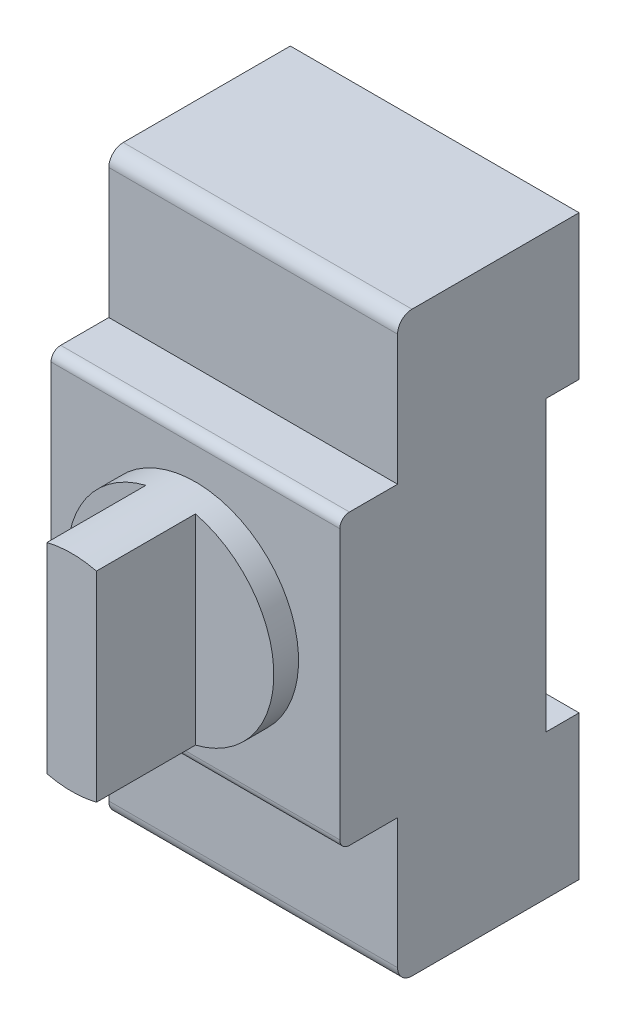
ISO-10303-21;
HEADER;
FILE_DESCRIPTION(('STEP AP214'),'2;1');
FILE_NAME('part.step','',(''),(''),'','','');
FILE_SCHEMA(('AUTOMOTIVE_DESIGN { 1 0 10303 214 1 1 1 1 }'));
ENDSEC;
DATA;
#1=APPLICATION_CONTEXT('core data for automotive mechanical design processes');
#2=APPLICATION_PROTOCOL_DEFINITION('international standard','automotive_design',2000,#1);
#3=PRODUCT_CONTEXT('',#1,'mechanical');
#4=PRODUCT('Part','Part','',(#3));
#5=PRODUCT_RELATED_PRODUCT_CATEGORY('part','',(#4));
#6=PRODUCT_DEFINITION_FORMATION('','',#4);
#7=PRODUCT_DEFINITION_CONTEXT('part definition',#1,'design');
#8=PRODUCT_DEFINITION('design','',#6,#7);
#9=PRODUCT_DEFINITION_SHAPE('','',#8);
#10=(LENGTH_UNIT() NAMED_UNIT(*) SI_UNIT(.MILLI.,.METRE.));
#11=(NAMED_UNIT(*) PLANE_ANGLE_UNIT() SI_UNIT($,.RADIAN.));
#12=(NAMED_UNIT(*) SI_UNIT($,.STERADIAN.) SOLID_ANGLE_UNIT());
#13=UNCERTAINTY_MEASURE_WITH_UNIT(LENGTH_MEASURE(1.E-05),#10,'distance_accuracy_value','');
#14=(GEOMETRIC_REPRESENTATION_CONTEXT(3) GLOBAL_UNCERTAINTY_ASSIGNED_CONTEXT((#13)) GLOBAL_UNIT_ASSIGNED_CONTEXT((#10,
#11,#12)) REPRESENTATION_CONTEXT('',''));
#15=CARTESIAN_POINT('',(0.,0.,0.));
#16=DIRECTION('',(0.,0.,1.));
#17=DIRECTION('',(1.,0.,0.));
#18=AXIS2_PLACEMENT_3D('',#15,#16,#17);
#19=CARTESIAN_POINT('',(35.,0.,25.));
#20=DIRECTION('',(0.,0.,-1.));
#21=DIRECTION('',(-1.,0.,0.));
#22=AXIS2_PLACEMENT_3D('',#19,#20,#21);
#23=PLANE('',#22);
#24=DIRECTION('',(0.,-1.,0.));
#25=VECTOR('',#24,1.);
#26=CARTESIAN_POINT('',(0.,0.,25.));
#27=LINE('',#26,#25);
#28=CARTESIAN_POINT('',(0.,-1.16666666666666,25.));
#29=VERTEX_POINT('',#28);
#30=CARTESIAN_POINT('',(0.,-33.8333333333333,25.));
#31=VERTEX_POINT('',#30);
#32=EDGE_CURVE('E241',#29,#31,#27,.T.);
#33=ORIENTED_EDGE('',*,*,#32,.T.);
#34=DIRECTION('',(-1.,0.,0.));
#35=VECTOR('',#34,1.);
#36=CARTESIAN_POINT('',(35.,-33.8333333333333,25.));
#37=LINE('',#36,#35);
#38=CARTESIAN_POINT('',(35.,-33.8333333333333,25.));
#39=VERTEX_POINT('',#38);
#40=EDGE_CURVE('E305',#31,#39,#37,.F.);
#41=ORIENTED_EDGE('',*,*,#40,.T.);
#42=DIRECTION('',(0.,-1.,0.));
#43=VECTOR('',#42,1.);
#44=CARTESIAN_POINT('',(35.,0.,25.));
#45=LINE('',#44,#43);
#46=CARTESIAN_POINT('',(35.,-1.16666666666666,25.));
#47=VERTEX_POINT('',#46);
#48=EDGE_CURVE('E215',#47,#39,#45,.T.);
#49=ORIENTED_EDGE('',*,*,#48,.F.);
#50=DIRECTION('',(-1.,0.,0.));
#51=VECTOR('',#50,1.);
#52=CARTESIAN_POINT('',(35.,-1.16666666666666,25.));
#53=LINE('',#52,#51);
#54=EDGE_CURVE('E302',#47,#29,#53,.T.);
#55=ORIENTED_EDGE('',*,*,#54,.T.);
#56=EDGE_LOOP('',(#33,#41,#49,#55));
#57=FACE_BOUND('',#56,.T.);
#58=CARTESIAN_POINT('',(17.5,-17.5,25.));
#59=DIRECTION('',(0.,0.,-1.));
#60=DIRECTION('',(-1.,0.,0.));
#61=AXIS2_PLACEMENT_3D('',#58,#59,#60);
#62=CIRCLE('',#61,12.5);
#63=CARTESIAN_POINT('',(5.00000000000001,-17.5,25.));
#64=VERTEX_POINT('',#63);
#65=EDGE_CURVE('E313',#64,#64,#62,.F.);
#66=ORIENTED_EDGE('',*,*,#65,.F.);
#67=EDGE_LOOP('',(#66));
#68=FACE_BOUND('',#67,.T.);
#69=ADVANCED_FACE('F36',(#57,#68),#23,.F.);
#70=CARTESIAN_POINT('',(35.,-35.,0.));
#71=DIRECTION('',(0.,0.,1.));
#72=DIRECTION('',(1.,0.,0.));
#73=AXIS2_PLACEMENT_3D('',#70,#71,#72);
#74=PLANE('',#73);
#75=DIRECTION('',(0.,1.,0.));
#76=VECTOR('',#75,1.);
#77=CARTESIAN_POINT('',(0.,-35.,0.));
#78=LINE('',#77,#76);
#79=CARTESIAN_POINT('',(0.,-35.,0.));
#80=VERTEX_POINT('',#79);
#81=CARTESIAN_POINT('',(0.,0.,0.));
#82=VERTEX_POINT('',#81);
#83=EDGE_CURVE('E190',#80,#82,#78,.T.);
#84=ORIENTED_EDGE('',*,*,#83,.T.);
#85=DIRECTION('',(-1.,0.,0.));
#86=VECTOR('',#85,1.);
#87=CARTESIAN_POINT('',(35.,0.,0.));
#88=LINE('',#87,#86);
#89=CARTESIAN_POINT('',(35.,0.,0.));
#90=VERTEX_POINT('',#89);
#91=EDGE_CURVE('E274',#90,#82,#88,.T.);
#92=ORIENTED_EDGE('',*,*,#91,.F.);
#93=DIRECTION('',(0.,1.,0.));
#94=VECTOR('',#93,1.);
#95=CARTESIAN_POINT('',(35.,-35.,0.));
#96=LINE('',#95,#94);
#97=CARTESIAN_POINT('',(35.,-35.,0.));
#98=VERTEX_POINT('',#97);
#99=EDGE_CURVE('E199',#98,#90,#96,.T.);
#100=ORIENTED_EDGE('',*,*,#99,.F.);
#101=DIRECTION('',(-1.,0.,0.));
#102=VECTOR('',#101,1.);
#103=CARTESIAN_POINT('',(35.,-35.,0.));
#104=LINE('',#103,#102);
#105=EDGE_CURVE('E228',#98,#80,#104,.T.);
#106=ORIENTED_EDGE('',*,*,#105,.T.);
#107=EDGE_LOOP('',(#84,#92,#100,#106));
#108=FACE_BOUND('',#107,.T.);
#109=ADVANCED_FACE('F339',(#108),#74,.F.);
#110=CARTESIAN_POINT('',(35.,0.,0.));
#111=DIRECTION('',(0.,1.,0.));
#112=DIRECTION('',(0.,0.,1.));
#113=AXIS2_PLACEMENT_3D('',#110,#111,#112);
#114=PLANE('',#113);
#115=DIRECTION('',(0.,0.,-1.));
#116=VECTOR('',#115,1.);
#117=CARTESIAN_POINT('',(0.,0.,0.));
#118=LINE('',#117,#116);
#119=CARTESIAN_POINT('',(0.,0.,-4.));
#120=VERTEX_POINT('',#119);
#121=EDGE_CURVE('E194',#82,#120,#118,.T.);
#122=ORIENTED_EDGE('',*,*,#121,.T.);
#123=DIRECTION('',(-1.,0.,0.));
#124=VECTOR('',#123,1.);
#125=CARTESIAN_POINT('',(35.,0.,-4.));
#126=LINE('',#125,#124);
#127=CARTESIAN_POINT('',(35.,0.,-4.));
#128=VERTEX_POINT('',#127);
#129=EDGE_CURVE('E271',#128,#120,#126,.T.);
#130=ORIENTED_EDGE('',*,*,#129,.F.);
#131=DIRECTION('',(0.,0.,-1.));
#132=VECTOR('',#131,1.);
#133=CARTESIAN_POINT('',(35.,0.,0.));
#134=LINE('',#133,#132);
#135=EDGE_CURVE('E202',#90,#128,#134,.T.);
#136=ORIENTED_EDGE('',*,*,#135,.F.);
#137=ORIENTED_EDGE('',*,*,#91,.T.);
#138=EDGE_LOOP('',(#122,#130,#136,#137));
#139=FACE_BOUND('',#138,.T.);
#140=ADVANCED_FACE('F345',(#139),#114,.F.);
#141=CARTESIAN_POINT('',(35.,0.,-4.));
#142=DIRECTION('',(0.,0.,1.));
#143=DIRECTION('',(0.,-1.,0.));
#144=AXIS2_PLACEMENT_3D('',#141,#142,#143);
#145=PLANE('',#144);
#146=DIRECTION('',(0.,1.,0.));
#147=VECTOR('',#146,1.);
#148=CARTESIAN_POINT('',(0.,0.,-4.));
#149=LINE('',#148,#147);
#150=CARTESIAN_POINT('',(0.,17.5,-4.));
#151=VERTEX_POINT('',#150);
#152=EDGE_CURVE('E231',#120,#151,#149,.T.);
#153=ORIENTED_EDGE('',*,*,#152,.T.);
#154=DIRECTION('',(-1.,0.,0.));
#155=VECTOR('',#154,1.);
#156=CARTESIAN_POINT('',(35.,17.5,-4.));
#157=LINE('',#156,#155);
#158=CARTESIAN_POINT('',(35.,17.5,-4.));
#159=VERTEX_POINT('',#158);
#160=EDGE_CURVE('E268',#159,#151,#157,.T.);
#161=ORIENTED_EDGE('',*,*,#160,.F.);
#162=DIRECTION('',(0.,1.,0.));
#163=VECTOR('',#162,1.);
#164=CARTESIAN_POINT('',(35.,0.,-4.));
#165=LINE('',#164,#163);
#166=EDGE_CURVE('E205',#128,#159,#165,.T.);
#167=ORIENTED_EDGE('',*,*,#166,.F.);
#168=ORIENTED_EDGE('',*,*,#129,.T.);
#169=EDGE_LOOP('',(#153,#161,#167,#168));
#170=FACE_BOUND('',#169,.T.);
#171=ADVANCED_FACE('F364',(#170),#145,.F.);
#172=CARTESIAN_POINT('',(35.,17.5,-4.));
#173=DIRECTION('',(0.,-1.,0.));
#174=DIRECTION('',(0.,0.,-1.));
#175=AXIS2_PLACEMENT_3D('',#172,#173,#174);
#176=PLANE('',#175);
#177=DIRECTION('',(0.,0.,1.));
#178=VECTOR('',#177,1.);
#179=CARTESIAN_POINT('',(0.,17.5,-4.));
#180=LINE('',#179,#178);
#181=CARTESIAN_POINT('',(0.,17.5,16.25));
#182=VERTEX_POINT('',#181);
#183=EDGE_CURVE('E233',#151,#182,#180,.T.);
#184=ORIENTED_EDGE('',*,*,#183,.T.);
#185=DIRECTION('',(-1.,0.,0.));
#186=VECTOR('',#185,1.);
#187=CARTESIAN_POINT('',(35.,17.5,16.25));
#188=LINE('',#187,#186);
#189=CARTESIAN_POINT('',(35.,17.5,16.25));
#190=VERTEX_POINT('',#189);
#191=EDGE_CURVE('E293',#182,#190,#188,.F.);
#192=ORIENTED_EDGE('',*,*,#191,.T.);
#193=DIRECTION('',(0.,0.,1.));
#194=VECTOR('',#193,1.);
#195=CARTESIAN_POINT('',(35.,17.5,-4.));
#196=LINE('',#195,#194);
#197=EDGE_CURVE('E207',#159,#190,#196,.T.);
#198=ORIENTED_EDGE('',*,*,#197,.F.);
#199=ORIENTED_EDGE('',*,*,#160,.T.);
#200=EDGE_LOOP('',(#184,#192,#198,#199));
#201=FACE_BOUND('',#200,.T.);
#202=ADVANCED_FACE('F360',(#201),#176,.F.);
#203=CARTESIAN_POINT('',(35.,17.5,18.));
#204=DIRECTION('',(0.,0.,-1.));
#205=DIRECTION('',(-1.,0.,0.));
#206=AXIS2_PLACEMENT_3D('',#203,#204,#205);
#207=PLANE('',#206);
#208=DIRECTION('',(0.,-1.,0.));
#209=VECTOR('',#208,1.);
#210=CARTESIAN_POINT('',(35.,17.5,18.));
#211=LINE('',#210,#209);
#212=CARTESIAN_POINT('',(35.,15.75,18.));
#213=VERTEX_POINT('',#212);
#214=CARTESIAN_POINT('',(35.,0.,18.));
#215=VERTEX_POINT('',#214);
#216=EDGE_CURVE('E210',#213,#215,#211,.T.);
#217=ORIENTED_EDGE('',*,*,#216,.F.);
#218=DIRECTION('',(-1.,0.,0.));
#219=VECTOR('',#218,1.);
#220=CARTESIAN_POINT('',(35.,15.75,18.));
#221=LINE('',#220,#219);
#222=CARTESIAN_POINT('',(0.,15.75,18.));
#223=VERTEX_POINT('',#222);
#224=EDGE_CURVE('E290',#213,#223,#221,.T.);
#225=ORIENTED_EDGE('',*,*,#224,.T.);
#226=DIRECTION('',(0.,-1.,0.));
#227=VECTOR('',#226,1.);
#228=CARTESIAN_POINT('',(0.,17.5,18.));
#229=LINE('',#228,#227);
#230=CARTESIAN_POINT('',(0.,0.,18.));
#231=VERTEX_POINT('',#230);
#232=EDGE_CURVE('E236',#223,#231,#229,.T.);
#233=ORIENTED_EDGE('',*,*,#232,.T.);
#234=DIRECTION('',(-1.,0.,0.));
#235=VECTOR('',#234,1.);
#236=CARTESIAN_POINT('',(35.,0.,18.));
#237=LINE('',#236,#235);
#238=EDGE_CURVE('E265',#215,#231,#237,.T.);
#239=ORIENTED_EDGE('',*,*,#238,.F.);
#240=EDGE_LOOP('',(#217,#225,#233,#239));
#241=FACE_BOUND('',#240,.T.);
#242=ADVANCED_FACE('F356',(#241),#207,.F.);
#243=CARTESIAN_POINT('',(35.,0.,18.));
#244=DIRECTION('',(0.,-1.,0.));
#245=DIRECTION('',(0.,0.,-1.));
#246=AXIS2_PLACEMENT_3D('',#243,#244,#245);
#247=PLANE('',#246);
#248=DIRECTION('',(0.,0.,1.));
#249=VECTOR('',#248,1.);
#250=CARTESIAN_POINT('',(0.,0.,18.));
#251=LINE('',#250,#249);
#252=CARTESIAN_POINT('',(0.,0.,23.8333333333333));
#253=VERTEX_POINT('',#252);
#254=EDGE_CURVE('E238',#231,#253,#251,.T.);
#255=ORIENTED_EDGE('',*,*,#254,.T.);
#256=DIRECTION('',(-1.,0.,0.));
#257=VECTOR('',#256,1.);
#258=CARTESIAN_POINT('',(35.,0.,23.8333333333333));
#259=LINE('',#258,#257);
#260=CARTESIAN_POINT('',(35.,0.,23.8333333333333));
#261=VERTEX_POINT('',#260);
#262=EDGE_CURVE('E311',#253,#261,#259,.F.);
#263=ORIENTED_EDGE('',*,*,#262,.T.);
#264=DIRECTION('',(0.,0.,1.));
#265=VECTOR('',#264,1.);
#266=CARTESIAN_POINT('',(35.,0.,18.));
#267=LINE('',#266,#265);
#268=EDGE_CURVE('E212',#215,#261,#267,.T.);
#269=ORIENTED_EDGE('',*,*,#268,.F.);
#270=ORIENTED_EDGE('',*,*,#238,.T.);
#271=EDGE_LOOP('',(#255,#263,#269,#270));
#272=FACE_BOUND('',#271,.T.);
#273=ADVANCED_FACE('F353',(#272),#247,.F.);
#274=CARTESIAN_POINT('',(35.,-35.,25.));
#275=DIRECTION('',(0.,1.,0.));
#276=DIRECTION('',(0.,0.,1.));
#277=AXIS2_PLACEMENT_3D('',#274,#275,#276);
#278=PLANE('',#277);
#279=DIRECTION('',(0.,0.,-1.));
#280=VECTOR('',#279,1.);
#281=CARTESIAN_POINT('',(35.,-35.,25.));
#282=LINE('',#281,#280);
#283=CARTESIAN_POINT('',(35.,-35.,23.8333333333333));
#284=VERTEX_POINT('',#283);
#285=CARTESIAN_POINT('',(35.,-35.,18.));
#286=VERTEX_POINT('',#285);
#287=EDGE_CURVE('E218',#284,#286,#282,.T.);
#288=ORIENTED_EDGE('',*,*,#287,.F.);
#289=DIRECTION('',(-1.,0.,0.));
#290=VECTOR('',#289,1.);
#291=CARTESIAN_POINT('',(35.,-35.,23.8333333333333));
#292=LINE('',#291,#290);
#293=CARTESIAN_POINT('',(0.,-35.,23.8333333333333));
#294=VERTEX_POINT('',#293);
#295=EDGE_CURVE('E295',#284,#294,#292,.T.);
#296=ORIENTED_EDGE('',*,*,#295,.T.);
#297=DIRECTION('',(0.,0.,-1.));
#298=VECTOR('',#297,1.);
#299=CARTESIAN_POINT('',(0.,-35.,25.));
#300=LINE('',#299,#298);
#301=CARTESIAN_POINT('',(0.,-35.,18.));
#302=VERTEX_POINT('',#301);
#303=EDGE_CURVE('E244',#294,#302,#300,.T.);
#304=ORIENTED_EDGE('',*,*,#303,.T.);
#305=DIRECTION('',(-1.,0.,0.));
#306=VECTOR('',#305,1.);
#307=CARTESIAN_POINT('',(35.,-35.,18.));
#308=LINE('',#307,#306);
#309=EDGE_CURVE('E262',#286,#302,#308,.T.);
#310=ORIENTED_EDGE('',*,*,#309,.F.);
#311=EDGE_LOOP('',(#288,#296,#304,#310));
#312=FACE_BOUND('',#311,.T.);
#313=ADVANCED_FACE('F351',(#312),#278,.F.);
#314=CARTESIAN_POINT('',(35.,-35.,18.));
#315=DIRECTION('',(0.,0.,-1.));
#316=DIRECTION('',(-1.,0.,0.));
#317=AXIS2_PLACEMENT_3D('',#314,#315,#316);
#318=PLANE('',#317);
#319=DIRECTION('',(0.,-1.,0.));
#320=VECTOR('',#319,1.);
#321=CARTESIAN_POINT('',(0.,-35.,18.));
#322=LINE('',#321,#320);
#323=CARTESIAN_POINT('',(0.,-50.75,18.));
#324=VERTEX_POINT('',#323);
#325=EDGE_CURVE('E246',#302,#324,#322,.T.);
#326=ORIENTED_EDGE('',*,*,#325,.T.);
#327=DIRECTION('',(-1.,0.,0.));
#328=VECTOR('',#327,1.);
#329=CARTESIAN_POINT('',(35.,-50.75,18.));
#330=LINE('',#329,#328);
#331=CARTESIAN_POINT('',(35.,-50.75,18.));
#332=VERTEX_POINT('',#331);
#333=EDGE_CURVE('E284',#324,#332,#330,.F.);
#334=ORIENTED_EDGE('',*,*,#333,.T.);
#335=DIRECTION('',(0.,-1.,0.));
#336=VECTOR('',#335,1.);
#337=CARTESIAN_POINT('',(35.,-35.,18.));
#338=LINE('',#337,#336);
#339=EDGE_CURVE('E220',#286,#332,#338,.T.);
#340=ORIENTED_EDGE('',*,*,#339,.F.);
#341=ORIENTED_EDGE('',*,*,#309,.T.);
#342=EDGE_LOOP('',(#326,#334,#340,#341));
#343=FACE_BOUND('',#342,.T.);
#344=ADVANCED_FACE('F400',(#343),#318,.F.);
#345=CARTESIAN_POINT('',(35.,-52.5,18.));
#346=DIRECTION('',(0.,1.,0.));
#347=DIRECTION('',(0.,0.,1.));
#348=AXIS2_PLACEMENT_3D('',#345,#346,#347);
#349=PLANE('',#348);
#350=DIRECTION('',(0.,0.,-1.));
#351=VECTOR('',#350,1.);
#352=CARTESIAN_POINT('',(35.,-52.5,18.));
#353=LINE('',#352,#351);
#354=CARTESIAN_POINT('',(35.,-52.5,16.25));
#355=VERTEX_POINT('',#354);
#356=CARTESIAN_POINT('',(35.,-52.5,-4.));
#357=VERTEX_POINT('',#356);
#358=EDGE_CURVE('E223',#355,#357,#353,.T.);
#359=ORIENTED_EDGE('',*,*,#358,.F.);
#360=DIRECTION('',(-1.,0.,0.));
#361=VECTOR('',#360,1.);
#362=CARTESIAN_POINT('',(35.,-52.5,16.25));
#363=LINE('',#362,#361);
#364=CARTESIAN_POINT('',(0.,-52.5,16.25));
#365=VERTEX_POINT('',#364);
#366=EDGE_CURVE('E277',#355,#365,#363,.T.);
#367=ORIENTED_EDGE('',*,*,#366,.T.);
#368=DIRECTION('',(0.,0.,-1.));
#369=VECTOR('',#368,1.);
#370=CARTESIAN_POINT('',(0.,-52.5,18.));
#371=LINE('',#370,#369);
#372=CARTESIAN_POINT('',(0.,-52.5,-4.));
#373=VERTEX_POINT('',#372);
#374=EDGE_CURVE('E249',#365,#373,#371,.T.);
#375=ORIENTED_EDGE('',*,*,#374,.T.);
#376=DIRECTION('',(-1.,0.,0.));
#377=VECTOR('',#376,1.);
#378=CARTESIAN_POINT('',(35.,-52.5,-4.));
#379=LINE('',#378,#377);
#380=EDGE_CURVE('E259',#357,#373,#379,.T.);
#381=ORIENTED_EDGE('',*,*,#380,.F.);
#382=EDGE_LOOP('',(#359,#367,#375,#381));
#383=FACE_BOUND('',#382,.T.);
#384=ADVANCED_FACE('F407',(#383),#349,.F.);
#385=CARTESIAN_POINT('',(35.,-52.5,-4.));
#386=DIRECTION('',(0.,0.,1.));
#387=DIRECTION('',(0.,-1.,0.));
#388=AXIS2_PLACEMENT_3D('',#385,#386,#387);
#389=PLANE('',#388);
#390=DIRECTION('',(0.,1.,0.));
#391=VECTOR('',#390,1.);
#392=CARTESIAN_POINT('',(0.,-52.5,-4.));
#393=LINE('',#392,#391);
#394=CARTESIAN_POINT('',(0.,-35.,-4.));
#395=VERTEX_POINT('',#394);
#396=EDGE_CURVE('E251',#373,#395,#393,.T.);
#397=ORIENTED_EDGE('',*,*,#396,.T.);
#398=DIRECTION('',(-1.,0.,0.));
#399=VECTOR('',#398,1.);
#400=CARTESIAN_POINT('',(35.,-35.,-4.));
#401=LINE('',#400,#399);
#402=CARTESIAN_POINT('',(35.,-35.,-4.));
#403=VERTEX_POINT('',#402);
#404=EDGE_CURVE('E256',#403,#395,#401,.T.);
#405=ORIENTED_EDGE('',*,*,#404,.F.);
#406=DIRECTION('',(0.,1.,0.));
#407=VECTOR('',#406,1.);
#408=CARTESIAN_POINT('',(35.,-52.5,-4.));
#409=LINE('',#408,#407);
#410=EDGE_CURVE('E225',#357,#403,#409,.T.);
#411=ORIENTED_EDGE('',*,*,#410,.F.);
#412=ORIENTED_EDGE('',*,*,#380,.T.);
#413=EDGE_LOOP('',(#397,#405,#411,#412));
#414=FACE_BOUND('',#413,.T.);
#415=ADVANCED_FACE('F415',(#414),#389,.F.);
#416=CARTESIAN_POINT('',(35.,-35.,-4.));
#417=DIRECTION('',(0.,-1.,0.));
#418=DIRECTION('',(0.,0.,-1.));
#419=AXIS2_PLACEMENT_3D('',#416,#417,#418);
#420=PLANE('',#419);
#421=DIRECTION('',(0.,0.,1.));
#422=VECTOR('',#421,1.);
#423=CARTESIAN_POINT('',(0.,-35.,-4.));
#424=LINE('',#423,#422);
#425=EDGE_CURVE('E203',#395,#80,#424,.T.);
#426=ORIENTED_EDGE('',*,*,#425,.T.);
#427=ORIENTED_EDGE('',*,*,#105,.F.);
#428=DIRECTION('',(0.,0.,1.));
#429=VECTOR('',#428,1.);
#430=CARTESIAN_POINT('',(35.,-35.,-4.));
#431=LINE('',#430,#429);
#432=EDGE_CURVE('E227',#403,#98,#431,.T.);
#433=ORIENTED_EDGE('',*,*,#432,.F.);
#434=ORIENTED_EDGE('',*,*,#404,.T.);
#435=EDGE_LOOP('',(#426,#427,#433,#434));
#436=FACE_BOUND('',#435,.T.);
#437=ADVANCED_FACE('F419',(#436),#420,.F.);
#438=CARTESIAN_POINT('',(35.,0.,0.));
#439=DIRECTION('',(-1.,0.,0.));
#440=DIRECTION('',(0.,0.,1.));
#441=AXIS2_PLACEMENT_3D('',#438,#439,#440);
#442=PLANE('',#441);
#443=ORIENTED_EDGE('',*,*,#48,.T.);
#444=CARTESIAN_POINT('',(35.,-33.8333333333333,23.8333333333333));
#445=DIRECTION('',(-1.,0.,0.));
#446=DIRECTION('',(0.,0.,1.));
#447=AXIS2_PLACEMENT_3D('',#444,#445,#446);
#448=CIRCLE('',#447,1.16666666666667);
#449=EDGE_CURVE('E309',#39,#284,#448,.F.);
#450=ORIENTED_EDGE('',*,*,#449,.T.);
#451=ORIENTED_EDGE('',*,*,#287,.T.);
#452=ORIENTED_EDGE('',*,*,#339,.T.);
#453=CARTESIAN_POINT('',(35.,-50.75,16.25));
#454=DIRECTION('',(-1.,0.,0.));
#455=DIRECTION('',(0.,0.,1.));
#456=AXIS2_PLACEMENT_3D('',#453,#454,#455);
#457=CIRCLE('',#456,1.75);
#458=EDGE_CURVE('E288',#332,#355,#457,.F.);
#459=ORIENTED_EDGE('',*,*,#458,.T.);
#460=ORIENTED_EDGE('',*,*,#358,.T.);
#461=ORIENTED_EDGE('',*,*,#410,.T.);
#462=ORIENTED_EDGE('',*,*,#432,.T.);
#463=ORIENTED_EDGE('',*,*,#99,.T.);
#464=ORIENTED_EDGE('',*,*,#135,.T.);
#465=ORIENTED_EDGE('',*,*,#166,.T.);
#466=ORIENTED_EDGE('',*,*,#197,.T.);
#467=CARTESIAN_POINT('',(35.,15.75,16.25));
#468=DIRECTION('',(-1.,0.,0.));
#469=DIRECTION('',(0.,0.,1.));
#470=AXIS2_PLACEMENT_3D('',#467,#468,#469);
#471=CIRCLE('',#470,1.75);
#472=EDGE_CURVE('E286',#190,#213,#471,.F.);
#473=ORIENTED_EDGE('',*,*,#472,.T.);
#474=ORIENTED_EDGE('',*,*,#216,.T.);
#475=ORIENTED_EDGE('',*,*,#268,.T.);
#476=CARTESIAN_POINT('',(35.,-1.16666666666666,23.8333333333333));
#477=DIRECTION('',(-1.,0.,0.));
#478=DIRECTION('',(0.,0.,1.));
#479=AXIS2_PLACEMENT_3D('',#476,#477,#478);
#480=CIRCLE('',#479,1.16666666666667);
#481=EDGE_CURVE('E307',#261,#47,#480,.F.);
#482=ORIENTED_EDGE('',*,*,#481,.T.);
#483=EDGE_LOOP('',(#443,#450,#451,#452,#459,#460,#461,#462,#463,#464,#465,#466,#473,#474,#475,#482));
#484=FACE_BOUND('',#483,.T.);
#485=ADVANCED_FACE('F392',(#484),#442,.F.);
#486=CARTESIAN_POINT('',(0.,0.,0.));
#487=DIRECTION('',(-1.,0.,0.));
#488=DIRECTION('',(0.,0.,1.));
#489=AXIS2_PLACEMENT_3D('',#486,#487,#488);
#490=PLANE('',#489);
#491=ORIENTED_EDGE('',*,*,#303,.F.);
#492=CARTESIAN_POINT('',(0.,-33.8333333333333,23.8333333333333));
#493=DIRECTION('',(-1.,0.,0.));
#494=DIRECTION('',(0.,0.,1.));
#495=AXIS2_PLACEMENT_3D('',#492,#493,#494);
#496=CIRCLE('',#495,1.16666666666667);
#497=EDGE_CURVE('E300',#294,#31,#496,.T.);
#498=ORIENTED_EDGE('',*,*,#497,.T.);
#499=ORIENTED_EDGE('',*,*,#32,.F.);
#500=CARTESIAN_POINT('',(0.,-1.16666666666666,23.8333333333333));
#501=DIRECTION('',(-1.,0.,0.));
#502=DIRECTION('',(0.,0.,1.));
#503=AXIS2_PLACEMENT_3D('',#500,#501,#502);
#504=CIRCLE('',#503,1.16666666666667);
#505=EDGE_CURVE('E298',#29,#253,#504,.T.);
#506=ORIENTED_EDGE('',*,*,#505,.T.);
#507=ORIENTED_EDGE('',*,*,#254,.F.);
#508=ORIENTED_EDGE('',*,*,#232,.F.);
#509=CARTESIAN_POINT('',(0.,15.75,16.25));
#510=DIRECTION('',(-1.,0.,0.));
#511=DIRECTION('',(0.,0.,1.));
#512=AXIS2_PLACEMENT_3D('',#509,#510,#511);
#513=CIRCLE('',#512,1.75);
#514=EDGE_CURVE('E280',#223,#182,#513,.T.);
#515=ORIENTED_EDGE('',*,*,#514,.T.);
#516=ORIENTED_EDGE('',*,*,#183,.F.);
#517=ORIENTED_EDGE('',*,*,#152,.F.);
#518=ORIENTED_EDGE('',*,*,#121,.F.);
#519=ORIENTED_EDGE('',*,*,#83,.F.);
#520=ORIENTED_EDGE('',*,*,#425,.F.);
#521=ORIENTED_EDGE('',*,*,#396,.F.);
#522=ORIENTED_EDGE('',*,*,#374,.F.);
#523=CARTESIAN_POINT('',(0.,-50.75,16.25));
#524=DIRECTION('',(-1.,0.,0.));
#525=DIRECTION('',(0.,0.,1.));
#526=AXIS2_PLACEMENT_3D('',#523,#524,#525);
#527=CIRCLE('',#526,1.75);
#528=EDGE_CURVE('E282',#365,#324,#527,.T.);
#529=ORIENTED_EDGE('',*,*,#528,.T.);
#530=ORIENTED_EDGE('',*,*,#325,.F.);
#531=EDGE_LOOP('',(#491,#498,#499,#506,#507,#508,#515,#516,#517,#518,#519,#520,#521,#522,#529,#530));
#532=FACE_BOUND('',#531,.T.);
#533=ADVANCED_FACE('F376',(#532),#490,.T.);
#534=CARTESIAN_POINT('',(35.,-50.75,16.25));
#535=DIRECTION('',(-1.,0.,0.));
#536=DIRECTION('',(0.,0.,1.));
#537=AXIS2_PLACEMENT_3D('',#534,#535,#536);
#538=CYLINDRICAL_SURFACE('',#537,1.75);
#539=ORIENTED_EDGE('',*,*,#458,.F.);
#540=ORIENTED_EDGE('',*,*,#333,.F.);
#541=ORIENTED_EDGE('',*,*,#528,.F.);
#542=ORIENTED_EDGE('',*,*,#366,.F.);
#543=EDGE_LOOP('',(#539,#540,#541,#542));
#544=FACE_BOUND('',#543,.T.);
#545=ADVANCED_FACE('F372',(#544),#538,.T.);
#546=CARTESIAN_POINT('',(35.,15.75,16.25));
#547=DIRECTION('',(-1.,0.,0.));
#548=DIRECTION('',(0.,0.,1.));
#549=AXIS2_PLACEMENT_3D('',#546,#547,#548);
#550=CYLINDRICAL_SURFACE('',#549,1.75);
#551=ORIENTED_EDGE('',*,*,#472,.F.);
#552=ORIENTED_EDGE('',*,*,#191,.F.);
#553=ORIENTED_EDGE('',*,*,#514,.F.);
#554=ORIENTED_EDGE('',*,*,#224,.F.);
#555=EDGE_LOOP('',(#551,#552,#553,#554));
#556=FACE_BOUND('',#555,.T.);
#557=ADVANCED_FACE('F375',(#556),#550,.T.);
#558=CARTESIAN_POINT('',(35.,-33.8333333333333,23.8333333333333));
#559=DIRECTION('',(-1.,0.,0.));
#560=DIRECTION('',(0.,0.,1.));
#561=AXIS2_PLACEMENT_3D('',#558,#559,#560);
#562=CYLINDRICAL_SURFACE('',#561,1.16666666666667);
#563=ORIENTED_EDGE('',*,*,#449,.F.);
#564=ORIENTED_EDGE('',*,*,#40,.F.);
#565=ORIENTED_EDGE('',*,*,#497,.F.);
#566=ORIENTED_EDGE('',*,*,#295,.F.);
#567=EDGE_LOOP('',(#563,#564,#565,#566));
#568=FACE_BOUND('',#567,.T.);
#569=ADVANCED_FACE('F379',(#568),#562,.T.);
#570=CARTESIAN_POINT('',(35.,-1.16666666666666,23.8333333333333));
#571=DIRECTION('',(-1.,0.,0.));
#572=DIRECTION('',(0.,0.,1.));
#573=AXIS2_PLACEMENT_3D('',#570,#571,#572);
#574=CYLINDRICAL_SURFACE('',#573,1.16666666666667);
#575=ORIENTED_EDGE('',*,*,#481,.F.);
#576=ORIENTED_EDGE('',*,*,#262,.F.);
#577=ORIENTED_EDGE('',*,*,#505,.F.);
#578=ORIENTED_EDGE('',*,*,#54,.F.);
#579=EDGE_LOOP('',(#575,#576,#577,#578));
#580=FACE_BOUND('',#579,.T.);
#581=ADVANCED_FACE('F38',(#580),#574,.T.);
#582=CARTESIAN_POINT('',(17.5,-17.5,75.3553390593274));
#583=DIRECTION('',(0.,0.,-1.));
#584=DIRECTION('',(-1.,0.,0.));
#585=AXIS2_PLACEMENT_3D('',#582,#583,#584);
#586=CYLINDRICAL_SURFACE('',#585,12.5);
#587=CARTESIAN_POINT('',(17.5,-17.5,40.));
#588=DIRECTION('',(0.,0.,1.));
#589=DIRECTION('',(1.,0.,0.));
#590=AXIS2_PLACEMENT_3D('',#587,#588,#589);
#591=CIRCLE('',#590,12.5);
#592=CARTESIAN_POINT('',(20.5,-5.36533890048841,40.));
#593=VERTEX_POINT('',#592);
#594=CARTESIAN_POINT('',(14.5,-5.36533890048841,40.));
#595=VERTEX_POINT('',#594);
#596=EDGE_CURVE('E191',#593,#595,#591,.T.);
#597=ORIENTED_EDGE('',*,*,#596,.F.);
#598=DIRECTION('',(0.,0.,-1.));
#599=VECTOR('',#598,1.);
#600=CARTESIAN_POINT('',(20.5,-5.36533890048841,75.3553390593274));
#601=LINE('',#600,#599);
#602=CARTESIAN_POINT('',(20.5,-5.36533890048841,28.));
#603=VERTEX_POINT('',#602);
#604=EDGE_CURVE('E51',#593,#603,#601,.T.);
#605=ORIENTED_EDGE('',*,*,#604,.T.);
#606=CARTESIAN_POINT('',(17.5,-17.5,28.));
#607=DIRECTION('',(0.,0.,1.));
#608=DIRECTION('',(1.,0.,0.));
#609=AXIS2_PLACEMENT_3D('',#606,#607,#608);
#610=CIRCLE('',#609,12.5);
#611=CARTESIAN_POINT('',(20.5,-29.6346610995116,28.));
#612=VERTEX_POINT('',#611);
#613=EDGE_CURVE('E11',#612,#603,#610,.T.);
#614=ORIENTED_EDGE('',*,*,#613,.F.);
#615=DIRECTION('',(0.,0.,-1.));
#616=VECTOR('',#615,1.);
#617=CARTESIAN_POINT('',(20.5,-29.6346610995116,75.3553390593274));
#618=LINE('',#617,#616);
#619=CARTESIAN_POINT('',(20.5,-29.6346610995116,40.));
#620=VERTEX_POINT('',#619);
#621=EDGE_CURVE('E174',#612,#620,#618,.F.);
#622=ORIENTED_EDGE('',*,*,#621,.T.);
#623=CARTESIAN_POINT('',(14.5,-29.6346610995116,40.));
#624=VERTEX_POINT('',#623);
#625=EDGE_CURVE('E185',#624,#620,#591,.T.);
#626=ORIENTED_EDGE('',*,*,#625,.F.);
#627=DIRECTION('',(0.,0.,-1.));
#628=VECTOR('',#627,1.);
#629=CARTESIAN_POINT('',(14.5,-29.6346610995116,75.3553390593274));
#630=LINE('',#629,#628);
#631=CARTESIAN_POINT('',(14.5,-29.6346610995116,28.));
#632=VERTEX_POINT('',#631);
#633=EDGE_CURVE('E59',#624,#632,#630,.T.);
#634=ORIENTED_EDGE('',*,*,#633,.T.);
#635=CARTESIAN_POINT('',(17.5,-17.5,28.));
#636=DIRECTION('',(0.,0.,-1.));
#637=DIRECTION('',(-1.,0.,0.));
#638=AXIS2_PLACEMENT_3D('',#635,#636,#637);
#639=CIRCLE('',#638,12.5);
#640=CARTESIAN_POINT('',(14.5,-5.36533890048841,28.));
#641=VERTEX_POINT('',#640);
#642=EDGE_CURVE('E179',#632,#641,#639,.T.);
#643=ORIENTED_EDGE('',*,*,#642,.T.);
#644=DIRECTION('',(0.,0.,-1.));
#645=VECTOR('',#644,1.);
#646=CARTESIAN_POINT('',(14.5,-5.36533890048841,75.3553390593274));
#647=LINE('',#646,#645);
#648=EDGE_CURVE('E319',#641,#595,#647,.F.);
#649=ORIENTED_EDGE('',*,*,#648,.T.);
#650=EDGE_LOOP('',(#597,#605,#614,#622,#626,#634,#643,#649));
#651=FACE_BOUND('',#650,.T.);
#652=ORIENTED_EDGE('',*,*,#65,.T.);
#653=EDGE_LOOP('',(#652));
#654=FACE_BOUND('',#653,.T.);
#655=ADVANCED_FACE('F183',(#651,#654),#586,.T.);
#656=CARTESIAN_POINT('',(0.,0.,40.));
#657=DIRECTION('',(0.,0.,1.));
#658=DIRECTION('',(1.,0.,0.));
#659=AXIS2_PLACEMENT_3D('',#656,#657,#658);
#660=PLANE('',#659);
#661=DIRECTION('',(0.,-1.,0.));
#662=VECTOR('',#661,1.);
#663=CARTESIAN_POINT('',(20.5,0.,40.));
#664=LINE('',#663,#662);
#665=EDGE_CURVE('E44',#593,#620,#664,.T.);
#666=ORIENTED_EDGE('',*,*,#665,.F.);
#667=ORIENTED_EDGE('',*,*,#596,.T.);
#668=DIRECTION('',(0.,1.,0.));
#669=VECTOR('',#668,1.);
#670=CARTESIAN_POINT('',(14.5,0.,40.));
#671=LINE('',#670,#669);
#672=EDGE_CURVE('E189',#624,#595,#671,.T.);
#673=ORIENTED_EDGE('',*,*,#672,.F.);
#674=ORIENTED_EDGE('',*,*,#625,.T.);
#675=EDGE_LOOP('',(#666,#667,#673,#674));
#676=FACE_BOUND('',#675,.T.);
#677=ADVANCED_FACE('F188',(#676),#660,.T.);
#678=CARTESIAN_POINT('',(14.5,-32.989679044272,28.));
#679=DIRECTION('',(0.,0.,-1.));
#680=DIRECTION('',(-1.,0.,0.));
#681=AXIS2_PLACEMENT_3D('',#678,#679,#680);
#682=PLANE('',#681);
#683=ORIENTED_EDGE('',*,*,#642,.F.);
#684=DIRECTION('',(0.,1.,0.));
#685=VECTOR('',#684,1.);
#686=CARTESIAN_POINT('',(14.5,-2.01032095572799,28.));
#687=LINE('',#686,#685);
#688=EDGE_CURVE('E323',#632,#641,#687,.T.);
#689=ORIENTED_EDGE('',*,*,#688,.T.);
#690=EDGE_LOOP('',(#683,#689));
#691=FACE_BOUND('',#690,.T.);
#692=ADVANCED_FACE('F324',(#691),#682,.F.);
#693=CARTESIAN_POINT('',(14.5,-2.01032095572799,28.));
#694=DIRECTION('',(1.,0.,0.));
#695=DIRECTION('',(0.,1.,0.));
#696=AXIS2_PLACEMENT_3D('',#693,#694,#695);
#697=PLANE('',#696);
#698=ORIENTED_EDGE('',*,*,#672,.T.);
#699=ORIENTED_EDGE('',*,*,#648,.F.);
#700=ORIENTED_EDGE('',*,*,#688,.F.);
#701=ORIENTED_EDGE('',*,*,#633,.F.);
#702=EDGE_LOOP('',(#698,#699,#700,#701));
#703=FACE_BOUND('',#702,.T.);
#704=ADVANCED_FACE('F322',(#703),#697,.F.);
#705=CARTESIAN_POINT('',(20.5,-32.989679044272,28.));
#706=DIRECTION('',(0.,0.,1.));
#707=DIRECTION('',(1.,0.,0.));
#708=AXIS2_PLACEMENT_3D('',#705,#706,#707);
#709=PLANE('',#708);
#710=ORIENTED_EDGE('',*,*,#613,.T.);
#711=DIRECTION('',(0.,-1.,0.));
#712=VECTOR('',#711,1.);
#713=CARTESIAN_POINT('',(20.5,-2.01032095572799,28.));
#714=LINE('',#713,#712);
#715=EDGE_CURVE('E186',#603,#612,#714,.T.);
#716=ORIENTED_EDGE('',*,*,#715,.T.);
#717=EDGE_LOOP('',(#710,#716));
#718=FACE_BOUND('',#717,.T.);
#719=ADVANCED_FACE('F329',(#718),#709,.T.);
#720=CARTESIAN_POINT('',(20.5,-2.01032095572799,28.));
#721=DIRECTION('',(-1.,0.,0.));
#722=DIRECTION('',(0.,0.,1.));
#723=AXIS2_PLACEMENT_3D('',#720,#721,#722);
#724=PLANE('',#723);
#725=ORIENTED_EDGE('',*,*,#665,.T.);
#726=ORIENTED_EDGE('',*,*,#621,.F.);
#727=ORIENTED_EDGE('',*,*,#715,.F.);
#728=ORIENTED_EDGE('',*,*,#604,.F.);
#729=EDGE_LOOP('',(#725,#726,#727,#728));
#730=FACE_BOUND('',#729,.T.);
#731=ADVANCED_FACE('F173',(#730),#724,.F.);
#732=CLOSED_SHELL('',(#69,#109,#140,#171,#202,#242,#273,#313,#344,#384,#415,#437,#485,#533,#545,
#557,#569,#581,#655,#677,#692,#704,#719,#731));
#733=MANIFOLD_SOLID_BREP('B2',#732);
#734=ADVANCED_BREP_SHAPE_REPRESENTATION('',(#18,#733),#14);
#735=SHAPE_DEFINITION_REPRESENTATION(#9,#734);
ENDSEC;
END-ISO-10303-21;
